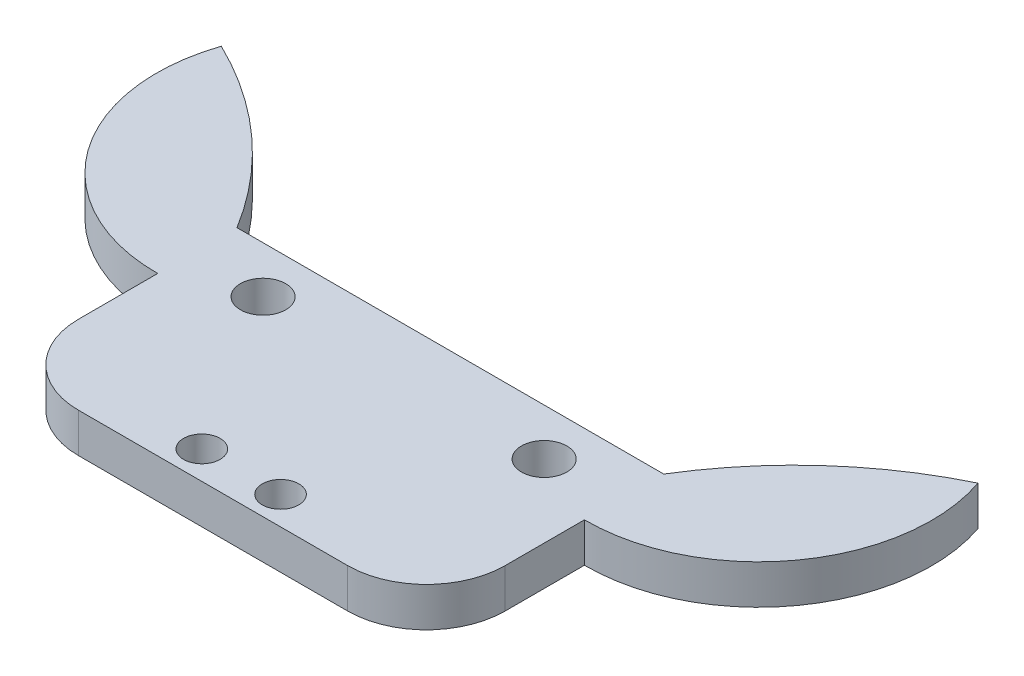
from build123d import *

# Parameters (mm, degrees)
SKETCH1_R      = 1.4732
SKETCH1_R_2    = 1.8288
EXTRUDE1_DEPTH = 3.175


with BuildPart() as part:
    # Sketch1 → Extrude1 (new body)
    with BuildSketch(Plane(origin=(0, 0, 0), x_dir=(1, 0, 0), z_dir=(0, 1, 0))):
        with BuildLine():
            Line((-17.209313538, 34.996011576), (-17.209313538, 28.599958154))
            ThreePointArc((-17.209313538, 28.599958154), (-15.349441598, 24.109830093), (-10.859313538, 22.249958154))
            Line((-10.859313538, 22.249958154), (10.859313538, 22.249958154))
            ThreePointArc((10.859313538, 22.249958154), (15.349441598, 24.109830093), (17.209313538, 28.599958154))
            Line((17.209313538, 28.599958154), (17.209313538, 34.996011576))
            ThreePointArc((17.209313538, 34.996011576), (28.616623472, 40.782865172), (30.517535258, 53.432012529))
            ThreePointArc((30.517535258, 53.432012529), (22.998763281, 48.367782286), (17.209313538, 41.392064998))
            Line((17.209313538, 41.392064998), (-17.209313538, 41.392064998))
            ThreePointArc((-17.209313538, 41.392064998), (-22.998763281, 48.367782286), (-30.517535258, 53.432012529))
            ThreePointArc((-30.517535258, 53.432012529), (-28.616623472, 40.782865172), (-17.209313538, 34.996011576))
        make_face()
        with Locations(Location((-3.175, 24.520410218, 0), (0, 0, 270))):
            Circle(SKETCH1_R, mode=Mode.SUBTRACT)
        with Locations(Location((3.175, 24.520410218, 0), (0, 0, 90))):
            Circle(SKETCH1_R, mode=Mode.SUBTRACT)
        with Locations(Location((-11.335612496, 37.620302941, 0), (0, 0, 270))):
            Circle(SKETCH1_R_2, mode=Mode.SUBTRACT)
        with Locations(Location((11.335612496, 37.620302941, 0), (0, 0, 90))):
            Circle(SKETCH1_R_2, mode=Mode.SUBTRACT)
    extrude(amount=EXTRUDE1_DEPTH)


solid = part.part
